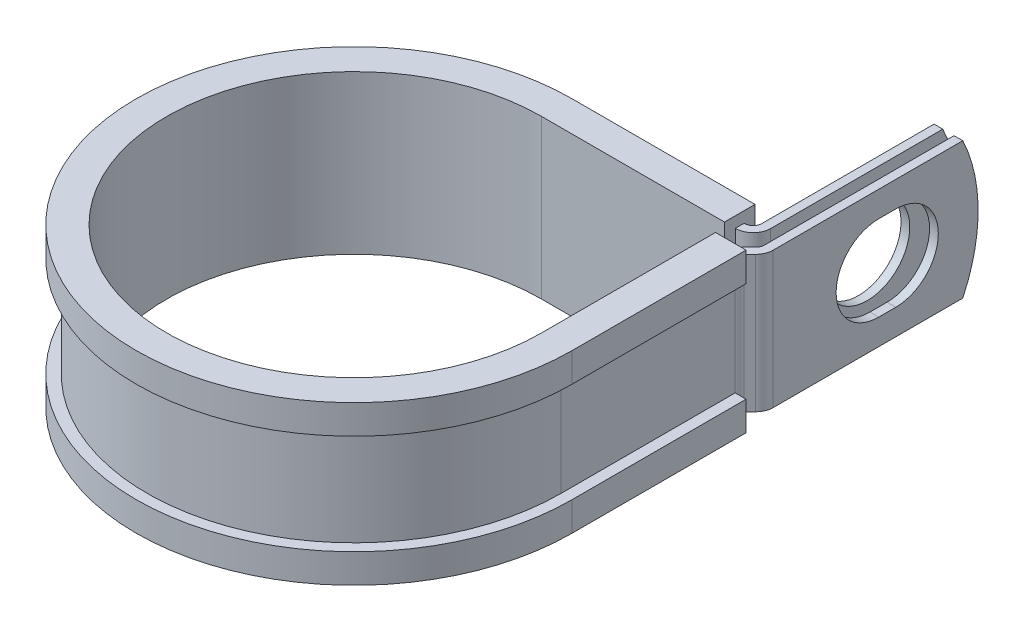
ISO-10303-21;
HEADER;
FILE_DESCRIPTION(('STEP AP214'),'2;1');
FILE_NAME('part.step','',(''),(''),'','','');
FILE_SCHEMA(('AUTOMOTIVE_DESIGN { 1 0 10303 214 1 1 1 1 }'));
ENDSEC;
DATA;
#1=APPLICATION_CONTEXT('core data for automotive mechanical design processes');
#2=APPLICATION_PROTOCOL_DEFINITION('international standard','automotive_design',2000,#1);
#3=PRODUCT_CONTEXT('',#1,'mechanical');
#4=PRODUCT('Part','Part','',(#3));
#5=PRODUCT_RELATED_PRODUCT_CATEGORY('part','',(#4));
#6=PRODUCT_DEFINITION_FORMATION('','',#4);
#7=PRODUCT_DEFINITION_CONTEXT('part definition',#1,'design');
#8=PRODUCT_DEFINITION('design','',#6,#7);
#9=PRODUCT_DEFINITION_SHAPE('','',#8);
#10=(LENGTH_UNIT() NAMED_UNIT(*) SI_UNIT(.MILLI.,.METRE.));
#11=(NAMED_UNIT(*) PLANE_ANGLE_UNIT() SI_UNIT($,.RADIAN.));
#12=(NAMED_UNIT(*) SI_UNIT($,.STERADIAN.) SOLID_ANGLE_UNIT());
#13=UNCERTAINTY_MEASURE_WITH_UNIT(LENGTH_MEASURE(1.E-05),#10,'distance_accuracy_value','');
#14=(GEOMETRIC_REPRESENTATION_CONTEXT(3) GLOBAL_UNCERTAINTY_ASSIGNED_CONTEXT((#13)) GLOBAL_UNIT_ASSIGNED_CONTEXT((#10,
#11,#12)) REPRESENTATION_CONTEXT('',''));
#15=CARTESIAN_POINT('',(0.,0.,0.));
#16=DIRECTION('',(0.,0.,1.));
#17=DIRECTION('',(1.,0.,0.));
#18=AXIS2_PLACEMENT_3D('',#15,#16,#17);
#19=CARTESIAN_POINT('',(28.3896698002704,-9.525,-27.7114));
#20=DIRECTION('',(0.,1.,0.));
#21=DIRECTION('',(1.,0.,0.));
#22=AXIS2_PLACEMENT_3D('',#19,#20,#21);
#23=PLANE('',#22);
#24=DIRECTION('',(0.,0.,-1.));
#25=VECTOR('',#24,1.);
#26=CARTESIAN_POINT('',(25.5448698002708,-9.525,-27.7114));
#27=LINE('',#26,#25);
#28=CARTESIAN_POINT('',(25.5448698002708,-9.525,-27.7114));
#29=VERTEX_POINT('',#28);
#30=CARTESIAN_POINT('',(25.5448698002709,-9.525,-28.9306));
#31=VERTEX_POINT('',#30);
#32=EDGE_CURVE('E524',#29,#31,#27,.T.);
#33=ORIENTED_EDGE('',*,*,#32,.T.);
#34=DIRECTION('',(1.,0.,0.));
#35=VECTOR('',#34,1.);
#36=CARTESIAN_POINT('',(0.,-9.525,-28.9306));
#37=LINE('',#36,#35);
#38=CARTESIAN_POINT('',(25.5956698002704,-9.525,-28.9306));
#39=VERTEX_POINT('',#38);
#40=EDGE_CURVE('E411',#39,#31,#37,.F.);
#41=ORIENTED_EDGE('',*,*,#40,.F.);
#42=CARTESIAN_POINT('',(25.5956698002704,-9.525,-30.1498));
#43=DIRECTION('',(0.,1.,0.));
#44=DIRECTION('',(1.,0.,0.));
#45=AXIS2_PLACEMENT_3D('',#42,#43,#44);
#46=CIRCLE('',#45,1.2192);
#47=CARTESIAN_POINT('',(26.8148698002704,-9.525,-30.1498));
#48=VERTEX_POINT('',#47);
#49=EDGE_CURVE('E409',#48,#39,#46,.F.);
#50=ORIENTED_EDGE('',*,*,#49,.F.);
#51=DIRECTION('',(0.,0.,1.));
#52=VECTOR('',#51,1.);
#53=CARTESIAN_POINT('',(26.8148698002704,-9.525,-56.3372));
#54=LINE('',#53,#52);
#55=CARTESIAN_POINT('',(26.8148698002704,-9.525,-54.1926631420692));
#56=VERTEX_POINT('',#55);
#57=EDGE_CURVE('E407',#56,#48,#54,.T.);
#58=ORIENTED_EDGE('',*,*,#57,.F.);
#59=DIRECTION('',(-1.,0.,0.));
#60=VECTOR('',#59,1.);
#61=CARTESIAN_POINT('',(30.8280698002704,-9.525,-54.1926631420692));
#62=LINE('',#61,#60);
#63=CARTESIAN_POINT('',(28.0340698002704,-9.525,-54.1926631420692));
#64=VERTEX_POINT('',#63);
#65=EDGE_CURVE('E12',#64,#56,#62,.T.);
#66=ORIENTED_EDGE('',*,*,#65,.F.);
#67=DIRECTION('',(0.,0.,1.));
#68=VECTOR('',#67,1.);
#69=CARTESIAN_POINT('',(28.0340698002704,-9.525,-56.3372));
#70=LINE('',#69,#68);
#71=CARTESIAN_POINT('',(28.0340698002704,-9.525,-30.1498));
#72=VERTEX_POINT('',#71);
#73=EDGE_CURVE('E405',#64,#72,#70,.T.);
#74=ORIENTED_EDGE('',*,*,#73,.T.);
#75=CARTESIAN_POINT('',(25.5956698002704,-9.525,-30.1498));
#76=DIRECTION('',(0.,-1.,0.));
#77=DIRECTION('',(0.,0.,1.));
#78=AXIS2_PLACEMENT_3D('',#75,#76,#77);
#79=CIRCLE('',#78,2.4384);
#80=CARTESIAN_POINT('',(25.5956698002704,-9.525,-27.7114));
#81=VERTEX_POINT('',#80);
#82=EDGE_CURVE('E402',#72,#81,#79,.T.);
#83=ORIENTED_EDGE('',*,*,#82,.T.);
#84=DIRECTION('',(-1.,0.,0.));
#85=VECTOR('',#84,1.);
#86=CARTESIAN_POINT('',(0.,-9.525,-27.7114));
#87=LINE('',#86,#85);
#88=EDGE_CURVE('E399',#81,#29,#87,.T.);
#89=ORIENTED_EDGE('',*,*,#88,.T.);
#90=EDGE_LOOP('',(#33,#41,#50,#58,#66,#74,#83,#89));
#91=FACE_BOUND('',#90,.T.);
#92=ADVANCED_FACE('F55',(#91),#23,.F.);
#93=CARTESIAN_POINT('',(28.3896698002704,9.525,-27.7114));
#94=DIRECTION('',(0.,1.,0.));
#95=DIRECTION('',(1.,0.,0.));
#96=AXIS2_PLACEMENT_3D('',#93,#94,#95);
#97=PLANE('',#96);
#98=DIRECTION('',(1.,0.,0.));
#99=VECTOR('',#98,1.);
#100=CARTESIAN_POINT('',(0.,9.525,-28.9306));
#101=LINE('',#100,#99);
#102=CARTESIAN_POINT('',(25.5956698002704,9.525,-28.9306));
#103=VERTEX_POINT('',#102);
#104=CARTESIAN_POINT('',(25.5448698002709,9.525,-28.9306));
#105=VERTEX_POINT('',#104);
#106=EDGE_CURVE('E369',#103,#105,#101,.F.);
#107=ORIENTED_EDGE('',*,*,#106,.T.);
#108=DIRECTION('',(0.,0.,1.));
#109=VECTOR('',#108,1.);
#110=CARTESIAN_POINT('',(25.5448698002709,9.525,-28.9306));
#111=LINE('',#110,#109);
#112=CARTESIAN_POINT('',(25.5448698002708,9.525,-27.7114));
#113=VERTEX_POINT('',#112);
#114=EDGE_CURVE('E518',#105,#113,#111,.T.);
#115=ORIENTED_EDGE('',*,*,#114,.T.);
#116=DIRECTION('',(-1.,0.,0.));
#117=VECTOR('',#116,1.);
#118=CARTESIAN_POINT('',(0.,9.525,-27.7114));
#119=LINE('',#118,#117);
#120=CARTESIAN_POINT('',(25.5956698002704,9.525,-27.7114));
#121=VERTEX_POINT('',#120);
#122=EDGE_CURVE('E626',#121,#113,#119,.T.);
#123=ORIENTED_EDGE('',*,*,#122,.F.);
#124=CARTESIAN_POINT('',(25.5956698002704,9.525,-30.1498));
#125=DIRECTION('',(0.,-1.,0.));
#126=DIRECTION('',(0.,0.,1.));
#127=AXIS2_PLACEMENT_3D('',#124,#125,#126);
#128=CIRCLE('',#127,2.4384);
#129=CARTESIAN_POINT('',(28.0340698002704,9.525,-30.1498));
#130=VERTEX_POINT('',#129);
#131=EDGE_CURVE('E371',#130,#121,#128,.T.);
#132=ORIENTED_EDGE('',*,*,#131,.F.);
#133=DIRECTION('',(0.,0.,1.));
#134=VECTOR('',#133,1.);
#135=CARTESIAN_POINT('',(28.0340698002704,9.525,-56.3372));
#136=LINE('',#135,#134);
#137=CARTESIAN_POINT('',(28.0340698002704,9.525,-54.1926631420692));
#138=VERTEX_POINT('',#137);
#139=EDGE_CURVE('E362',#138,#130,#136,.T.);
#140=ORIENTED_EDGE('',*,*,#139,.F.);
#141=DIRECTION('',(-1.,0.,0.));
#142=VECTOR('',#141,1.);
#143=CARTESIAN_POINT('',(30.8280698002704,9.525,-54.1926631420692));
#144=LINE('',#143,#142);
#145=CARTESIAN_POINT('',(26.8148698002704,9.525,-54.1926631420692));
#146=VERTEX_POINT('',#145);
#147=EDGE_CURVE('E63',#138,#146,#144,.T.);
#148=ORIENTED_EDGE('',*,*,#147,.T.);
#149=DIRECTION('',(0.,0.,1.));
#150=VECTOR('',#149,1.);
#151=CARTESIAN_POINT('',(26.8148698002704,9.525,-56.3372));
#152=LINE('',#151,#150);
#153=CARTESIAN_POINT('',(26.8148698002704,9.525,-30.1498));
#154=VERTEX_POINT('',#153);
#155=EDGE_CURVE('E359',#146,#154,#152,.T.);
#156=ORIENTED_EDGE('',*,*,#155,.T.);
#157=CARTESIAN_POINT('',(25.5956698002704,9.525,-30.1498));
#158=DIRECTION('',(0.,1.,0.));
#159=DIRECTION('',(1.,0.,0.));
#160=AXIS2_PLACEMENT_3D('',#157,#158,#159);
#161=CIRCLE('',#160,1.2192);
#162=EDGE_CURVE('E367',#154,#103,#161,.F.);
#163=ORIENTED_EDGE('',*,*,#162,.T.);
#164=EDGE_LOOP('',(#107,#115,#123,#132,#140,#148,#156,#163));
#165=FACE_BOUND('',#164,.T.);
#166=ADVANCED_FACE('F358',(#165),#97,.T.);
#167=CARTESIAN_POINT('',(0.,9.525,-27.7114));
#168=DIRECTION('',(0.,0.,1.));
#169=DIRECTION('',(1.,0.,0.));
#170=AXIS2_PLACEMENT_3D('',#167,#168,#169);
#171=PLANE('',#170);
#172=ORIENTED_EDGE('',*,*,#122,.T.);
#173=DIRECTION('',(0.,-1.,0.));
#174=VECTOR('',#173,1.);
#175=CARTESIAN_POINT('',(25.5448698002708,9.525,-27.7114));
#176=LINE('',#175,#174);
#177=EDGE_CURVE('E521',#113,#29,#176,.T.);
#178=ORIENTED_EDGE('',*,*,#177,.T.);
#179=ORIENTED_EDGE('',*,*,#88,.F.);
#180=DIRECTION('',(0.,-1.,0.));
#181=VECTOR('',#180,1.);
#182=CARTESIAN_POINT('',(25.5956698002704,9.525,-27.7114));
#183=LINE('',#182,#181);
#184=EDGE_CURVE('E345',#121,#81,#183,.T.);
#185=ORIENTED_EDGE('',*,*,#184,.F.);
#186=EDGE_LOOP('',(#172,#178,#179,#185));
#187=FACE_BOUND('',#186,.T.);
#188=ADVANCED_FACE('F636',(#187),#171,.T.);
#189=CARTESIAN_POINT('',(30.8280698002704,9.525,-27.7114));
#190=DIRECTION('',(-1.,0.,0.));
#191=DIRECTION('',(0.,0.,1.));
#192=AXIS2_PLACEMENT_3D('',#189,#190,#191);
#193=PLANE('',#192);
#194=CARTESIAN_POINT('',(30.8280698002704,0.,-44.8309999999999));
#195=DIRECTION('',(1.,0.,0.));
#196=DIRECTION('',(0.,0.,-1.));
#197=AXIS2_PLACEMENT_3D('',#194,#195,#196);
#198=CIRCLE('',#197,5.9436);
#199=CARTESIAN_POINT('',(30.8280698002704,-5.9436,-44.8310000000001));
#200=VERTEX_POINT('',#199);
#201=CARTESIAN_POINT('',(30.8280698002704,5.9436,-44.8310000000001));
#202=VERTEX_POINT('',#201);
#203=EDGE_CURVE('E581',#200,#202,#198,.T.);
#204=ORIENTED_EDGE('',*,*,#203,.F.);
#205=DIRECTION('',(0.,0.,-1.));
#206=VECTOR('',#205,1.);
#207=CARTESIAN_POINT('',(30.8280698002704,-5.9436,-42.4433999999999));
#208=LINE('',#207,#206);
#209=CARTESIAN_POINT('',(30.8280698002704,-5.9436,-42.4433999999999));
#210=VERTEX_POINT('',#209);
#211=EDGE_CURVE('E584',#210,#200,#208,.T.);
#212=ORIENTED_EDGE('',*,*,#211,.F.);
#213=CARTESIAN_POINT('',(30.8280698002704,0.,-42.4433999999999));
#214=DIRECTION('',(1.,0.,0.));
#215=DIRECTION('',(0.,0.,-1.));
#216=AXIS2_PLACEMENT_3D('',#213,#214,#215);
#217=CIRCLE('',#216,5.9436);
#218=CARTESIAN_POINT('',(30.8280698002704,5.9436,-42.4433999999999));
#219=VERTEX_POINT('',#218);
#220=EDGE_CURVE('E577',#219,#210,#217,.T.);
#221=ORIENTED_EDGE('',*,*,#220,.F.);
#222=DIRECTION('',(0.,0.,1.));
#223=VECTOR('',#222,1.);
#224=CARTESIAN_POINT('',(30.8280698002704,5.9436,-42.4433999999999));
#225=LINE('',#224,#223);
#226=EDGE_CURVE('E578',#202,#219,#225,.T.);
#227=ORIENTED_EDGE('',*,*,#226,.F.);
#228=EDGE_LOOP('',(#204,#212,#221,#227));
#229=FACE_BOUND('',#228,.T.);
#230=DIRECTION('',(0.,0.,-1.));
#231=VECTOR('',#230,1.);
#232=CARTESIAN_POINT('',(30.8280698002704,-9.525,-27.7114));
#233=LINE('',#232,#231);
#234=CARTESIAN_POINT('',(30.8280698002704,-9.525,-27.7114));
#235=VERTEX_POINT('',#234);
#236=CARTESIAN_POINT('',(30.8280698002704,-9.525,-54.1926631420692));
#237=VERTEX_POINT('',#236);
#238=EDGE_CURVE('E383',#235,#237,#233,.T.);
#239=ORIENTED_EDGE('',*,*,#238,.T.);
#240=CARTESIAN_POINT('',(30.8280698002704,0.,-34.1122));
#241=DIRECTION('',(-1.,0.,0.));
#242=DIRECTION('',(0.,0.,1.));
#243=AXIS2_PLACEMENT_3D('',#240,#241,#242);
#244=CIRCLE('',#243,22.225);
#245=CARTESIAN_POINT('',(30.8280698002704,9.525,-54.1926631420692));
#246=VERTEX_POINT('',#245);
#247=EDGE_CURVE('E569',#246,#237,#244,.T.);
#248=ORIENTED_EDGE('',*,*,#247,.F.);
#249=DIRECTION('',(0.,0.,-1.));
#250=VECTOR('',#249,1.);
#251=CARTESIAN_POINT('',(30.8280698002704,9.525,-27.7114));
#252=LINE('',#251,#250);
#253=CARTESIAN_POINT('',(30.8280698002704,9.525,-27.7114));
#254=VERTEX_POINT('',#253);
#255=EDGE_CURVE('E420',#254,#246,#252,.T.);
#256=ORIENTED_EDGE('',*,*,#255,.F.);
#257=DIRECTION('',(0.,-1.,0.));
#258=VECTOR('',#257,1.);
#259=CARTESIAN_POINT('',(30.8280698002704,9.525,-27.7114));
#260=LINE('',#259,#258);
#261=EDGE_CURVE('E382',#254,#235,#260,.T.);
#262=ORIENTED_EDGE('',*,*,#261,.T.);
#263=EDGE_LOOP('',(#239,#248,#256,#262));
#264=FACE_BOUND('',#263,.T.);
#265=ADVANCED_FACE('F57',(#229,#264),#193,.F.);
#266=CARTESIAN_POINT('',(29.6088698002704,9.525,-27.7114));
#267=DIRECTION('',(-1.,0.,0.));
#268=DIRECTION('',(0.,0.,1.));
#269=AXIS2_PLACEMENT_3D('',#266,#267,#268);
#270=PLANE('',#269);
#271=DIRECTION('',(0.,0.,-1.));
#272=VECTOR('',#271,1.);
#273=CARTESIAN_POINT('',(29.6088698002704,-5.9436,-42.4433999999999));
#274=LINE('',#273,#272);
#275=CARTESIAN_POINT('',(29.6088698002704,-5.9436,-42.4433999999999));
#276=VERTEX_POINT('',#275);
#277=CARTESIAN_POINT('',(29.6088698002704,-5.9436,-44.8310000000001));
#278=VERTEX_POINT('',#277);
#279=EDGE_CURVE('E580',#276,#278,#274,.T.);
#280=ORIENTED_EDGE('',*,*,#279,.T.);
#281=CARTESIAN_POINT('',(29.6088698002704,0.,-44.8309999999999));
#282=DIRECTION('',(-1.,0.,0.));
#283=DIRECTION('',(0.,0.,1.));
#284=AXIS2_PLACEMENT_3D('',#281,#282,#283);
#285=CIRCLE('',#284,5.9436);
#286=CARTESIAN_POINT('',(29.6088698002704,5.9436,-44.8310000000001));
#287=VERTEX_POINT('',#286);
#288=EDGE_CURVE('E601',#278,#287,#285,.F.);
#289=ORIENTED_EDGE('',*,*,#288,.T.);
#290=DIRECTION('',(0.,0.,1.));
#291=VECTOR('',#290,1.);
#292=CARTESIAN_POINT('',(29.6088698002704,5.9436,-42.4433999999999));
#293=LINE('',#292,#291);
#294=CARTESIAN_POINT('',(29.6088698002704,5.9436,-42.4433999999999));
#295=VERTEX_POINT('',#294);
#296=EDGE_CURVE('E597',#287,#295,#293,.T.);
#297=ORIENTED_EDGE('',*,*,#296,.T.);
#298=CARTESIAN_POINT('',(29.6088698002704,0.,-42.4433999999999));
#299=DIRECTION('',(-1.,0.,0.));
#300=DIRECTION('',(0.,0.,1.));
#301=AXIS2_PLACEMENT_3D('',#298,#299,#300);
#302=CIRCLE('',#301,5.9436);
#303=EDGE_CURVE('E592',#295,#276,#302,.F.);
#304=ORIENTED_EDGE('',*,*,#303,.T.);
#305=EDGE_LOOP('',(#280,#289,#297,#304));
#306=FACE_BOUND('',#305,.T.);
#307=CARTESIAN_POINT('',(29.6088698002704,0.,-34.1122));
#308=DIRECTION('',(-1.,0.,0.));
#309=DIRECTION('',(0.,0.,1.));
#310=AXIS2_PLACEMENT_3D('',#307,#308,#309);
#311=CIRCLE('',#310,22.225);
#312=CARTESIAN_POINT('',(29.6088698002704,9.525,-54.1926631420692));
#313=VERTEX_POINT('',#312);
#314=CARTESIAN_POINT('',(29.6088698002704,-9.525,-54.1926631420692));
#315=VERTEX_POINT('',#314);
#316=EDGE_CURVE('E77',#313,#315,#311,.T.);
#317=ORIENTED_EDGE('',*,*,#316,.T.);
#318=DIRECTION('',(0.,0.,-1.));
#319=VECTOR('',#318,1.);
#320=CARTESIAN_POINT('',(29.6088698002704,-9.525,-27.7114));
#321=LINE('',#320,#319);
#322=CARTESIAN_POINT('',(29.6088698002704,-9.525,-27.7114));
#323=VERTEX_POINT('',#322);
#324=EDGE_CURVE('E386',#323,#315,#321,.T.);
#325=ORIENTED_EDGE('',*,*,#324,.F.);
#326=DIRECTION('',(0.,-1.,0.));
#327=VECTOR('',#326,1.);
#328=CARTESIAN_POINT('',(29.6088698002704,9.525,-27.7114));
#329=LINE('',#328,#327);
#330=CARTESIAN_POINT('',(29.6088698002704,9.525,-27.7114));
#331=VERTEX_POINT('',#330);
#332=EDGE_CURVE('E353',#331,#323,#329,.T.);
#333=ORIENTED_EDGE('',*,*,#332,.F.);
#334=DIRECTION('',(0.,0.,-1.));
#335=VECTOR('',#334,1.);
#336=CARTESIAN_POINT('',(29.6088698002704,9.525,-27.7114));
#337=LINE('',#336,#335);
#338=EDGE_CURVE('E616',#331,#313,#337,.T.);
#339=ORIENTED_EDGE('',*,*,#338,.T.);
#340=EDGE_LOOP('',(#317,#325,#333,#339));
#341=FACE_BOUND('',#340,.T.);
#342=ADVANCED_FACE('F690',(#306,#341),#270,.T.);
#343=CARTESIAN_POINT('',(28.0340698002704,9.525,-56.3372));
#344=DIRECTION('',(1.,0.,0.));
#345=DIRECTION('',(0.,0.,-1.));
#346=AXIS2_PLACEMENT_3D('',#343,#344,#345);
#347=PLANE('',#346);
#348=CARTESIAN_POINT('',(28.0340698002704,0.,-43.6372));
#349=DIRECTION('',(1.,0.,0.));
#350=DIRECTION('',(0.,0.,-1.));
#351=AXIS2_PLACEMENT_3D('',#348,#349,#350);
#352=CIRCLE('',#351,5.9436);
#353=CARTESIAN_POINT('',(28.0340698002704,0.,-49.5808));
#354=VERTEX_POINT('',#353);
#355=EDGE_CURVE('E387',#354,#354,#352,.F.);
#356=ORIENTED_EDGE('',*,*,#355,.T.);
#357=EDGE_LOOP('',(#356));
#358=FACE_BOUND('',#357,.T.);
#359=ORIENTED_EDGE('',*,*,#73,.F.);
#360=CARTESIAN_POINT('',(28.0340698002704,0.,-34.1122));
#361=DIRECTION('',(1.,0.,0.));
#362=DIRECTION('',(0.,0.,-1.));
#363=AXIS2_PLACEMENT_3D('',#360,#361,#362);
#364=CIRCLE('',#363,22.225);
#365=EDGE_CURVE('E574',#64,#138,#364,.T.);
#366=ORIENTED_EDGE('',*,*,#365,.T.);
#367=ORIENTED_EDGE('',*,*,#139,.T.);
#368=DIRECTION('',(0.,-1.,0.));
#369=VECTOR('',#368,1.);
#370=CARTESIAN_POINT('',(28.0340698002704,9.525,-30.1498));
#371=LINE('',#370,#369);
#372=EDGE_CURVE('E342',#130,#72,#371,.T.);
#373=ORIENTED_EDGE('',*,*,#372,.T.);
#374=EDGE_LOOP('',(#359,#366,#367,#373));
#375=FACE_BOUND('',#374,.T.);
#376=ADVANCED_FACE('F642',(#358,#375),#347,.T.);
#377=CARTESIAN_POINT('',(26.8148698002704,9.525,-56.3372));
#378=DIRECTION('',(1.,0.,0.));
#379=DIRECTION('',(0.,0.,-1.));
#380=AXIS2_PLACEMENT_3D('',#377,#378,#379);
#381=PLANE('',#380);
#382=CARTESIAN_POINT('',(26.8148698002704,0.,-43.6372));
#383=DIRECTION('',(-1.,0.,0.));
#384=DIRECTION('',(0.,0.,1.));
#385=AXIS2_PLACEMENT_3D('',#382,#383,#384);
#386=CIRCLE('',#385,5.9436);
#387=CARTESIAN_POINT('',(26.8148698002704,0.,-37.6936));
#388=VERTEX_POINT('',#387);
#389=EDGE_CURVE('E609',#388,#388,#386,.T.);
#390=ORIENTED_EDGE('',*,*,#389,.F.);
#391=EDGE_LOOP('',(#390));
#392=FACE_BOUND('',#391,.T.);
#393=CARTESIAN_POINT('',(26.8148698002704,0.,-34.1122));
#394=DIRECTION('',(-1.,0.,0.));
#395=DIRECTION('',(0.,0.,1.));
#396=AXIS2_PLACEMENT_3D('',#393,#394,#395);
#397=CIRCLE('',#396,22.225);
#398=EDGE_CURVE('E69',#146,#56,#397,.T.);
#399=ORIENTED_EDGE('',*,*,#398,.T.);
#400=ORIENTED_EDGE('',*,*,#57,.T.);
#401=DIRECTION('',(0.,-1.,0.));
#402=VECTOR('',#401,1.);
#403=CARTESIAN_POINT('',(26.8148698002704,9.525,-30.1498));
#404=LINE('',#403,#402);
#405=EDGE_CURVE('E339',#154,#48,#404,.T.);
#406=ORIENTED_EDGE('',*,*,#405,.F.);
#407=ORIENTED_EDGE('',*,*,#155,.F.);
#408=EDGE_LOOP('',(#399,#400,#406,#407));
#409=FACE_BOUND('',#408,.T.);
#410=ADVANCED_FACE('F365',(#392,#409),#381,.F.);
#411=CARTESIAN_POINT('',(30.1498,-9.525,-24.2989026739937));
#412=DIRECTION('',(0.,1.,0.));
#413=DIRECTION('',(1.,0.,0.));
#414=AXIS2_PLACEMENT_3D('',#411,#412,#413);
#415=CIRCLE('',#414,1.2192);
#416=CARTESIAN_POINT('',(28.9306,-9.525,-24.2989026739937));
#417=VERTEX_POINT('',#416);
#418=CARTESIAN_POINT('',(29.2876954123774,-9.525,-25.1610072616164));
#419=VERTEX_POINT('',#418);
#420=EDGE_CURVE('E414',#417,#419,#415,.F.);
#421=ORIENTED_EDGE('',*,*,#420,.F.);
#422=DIRECTION('',(1.,0.,0.));
#423=VECTOR('',#422,1.);
#424=CARTESIAN_POINT('',(27.7114,-9.525,-24.2989026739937));
#425=LINE('',#424,#423);
#426=CARTESIAN_POINT('',(27.7114,-9.525,-24.2989026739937));
#427=VERTEX_POINT('',#426);
#428=EDGE_CURVE('E452',#427,#417,#425,.T.);
#429=ORIENTED_EDGE('',*,*,#428,.F.);
#430=CARTESIAN_POINT('',(30.1498,-9.525,-24.2989026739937));
#431=DIRECTION('',(0.,-1.,0.));
#432=DIRECTION('',(0.,0.,1.));
#433=AXIS2_PLACEMENT_3D('',#430,#431,#432);
#434=CIRCLE('',#433,2.4384);
#435=CARTESIAN_POINT('',(28.4255908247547,-9.525,-26.023111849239));
#436=VERTEX_POINT('',#435);
#437=EDGE_CURVE('E396',#427,#436,#434,.T.);
#438=ORIENTED_EDGE('',*,*,#437,.T.);
#439=DIRECTION('',(0.707106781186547,0.,-0.707106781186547));
#440=VECTOR('',#439,1.);
#441=CARTESIAN_POINT('',(28.4255908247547,-9.525,-26.023111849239));
#442=LINE('',#441,#440);
#443=CARTESIAN_POINT('',(29.2517743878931,-9.525,-26.8492954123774));
#444=VERTEX_POINT('',#443);
#445=EDGE_CURVE('E393',#436,#444,#442,.T.);
#446=ORIENTED_EDGE('',*,*,#445,.T.);
#447=CARTESIAN_POINT('',(28.3896698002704,-9.525,-27.7114));
#448=DIRECTION('',(0.,1.,0.));
#449=DIRECTION('',(0.,0.,1.));
#450=AXIS2_PLACEMENT_3D('',#447,#448,#449);
#451=CIRCLE('',#450,1.2192);
#452=EDGE_CURVE('E390',#444,#323,#451,.T.);
#453=ORIENTED_EDGE('',*,*,#452,.T.);
#454=ORIENTED_EDGE('',*,*,#324,.T.);
#455=DIRECTION('',(-1.,0.,0.));
#456=VECTOR('',#455,1.);
#457=CARTESIAN_POINT('',(30.8280698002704,-9.525,-54.1926631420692));
#458=LINE('',#457,#456);
#459=EDGE_CURVE('E567',#237,#315,#458,.T.);
#460=ORIENTED_EDGE('',*,*,#459,.F.);
#461=ORIENTED_EDGE('',*,*,#238,.F.);
#462=CARTESIAN_POINT('',(28.3896698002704,-9.525,-27.7114));
#463=DIRECTION('',(0.,1.,0.));
#464=DIRECTION('',(1.,0.,0.));
#465=AXIS2_PLACEMENT_3D('',#462,#463,#464);
#466=CIRCLE('',#465,2.4384);
#467=CARTESIAN_POINT('',(30.1138789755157,-9.525,-25.9871908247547));
#468=VERTEX_POINT('',#467);
#469=EDGE_CURVE('E418',#468,#235,#466,.T.);
#470=ORIENTED_EDGE('',*,*,#469,.F.);
#471=DIRECTION('',(0.707106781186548,0.,-0.707106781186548));
#472=VECTOR('',#471,1.);
#473=CARTESIAN_POINT('',(29.2876954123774,-9.525,-25.1610072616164));
#474=LINE('',#473,#472);
#475=EDGE_CURVE('E416',#419,#468,#474,.T.);
#476=ORIENTED_EDGE('',*,*,#475,.F.);
#477=EDGE_LOOP('',(#421,#429,#438,#446,#453,#454,#460,#461,#470,#476));
#478=FACE_BOUND('',#477,.T.);
#479=ADVANCED_FACE('F676',(#478),#23,.F.);
#480=DIRECTION('',(-1.,0.,0.));
#481=VECTOR('',#480,1.);
#482=CARTESIAN_POINT('',(28.9306,9.525,-24.2989026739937));
#483=LINE('',#482,#481);
#484=CARTESIAN_POINT('',(28.9306,9.525,-24.2989026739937));
#485=VERTEX_POINT('',#484);
#486=CARTESIAN_POINT('',(27.7114,9.525,-24.2989026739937));
#487=VERTEX_POINT('',#486);
#488=EDGE_CURVE('E441',#485,#487,#483,.T.);
#489=ORIENTED_EDGE('',*,*,#488,.F.);
#490=CARTESIAN_POINT('',(30.1498,9.525,-24.2989026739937));
#491=DIRECTION('',(0.,1.,0.));
#492=DIRECTION('',(1.,0.,0.));
#493=AXIS2_PLACEMENT_3D('',#490,#491,#492);
#494=CIRCLE('',#493,1.2192);
#495=CARTESIAN_POINT('',(29.2876954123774,9.525,-25.1610072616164));
#496=VERTEX_POINT('',#495);
#497=EDGE_CURVE('E376',#485,#496,#494,.F.);
#498=ORIENTED_EDGE('',*,*,#497,.T.);
#499=DIRECTION('',(0.707106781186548,0.,-0.707106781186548));
#500=VECTOR('',#499,1.);
#501=CARTESIAN_POINT('',(29.2876954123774,9.525,-25.1610072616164));
#502=LINE('',#501,#500);
#503=CARTESIAN_POINT('',(30.1138789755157,9.525,-25.9871908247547));
#504=VERTEX_POINT('',#503);
#505=EDGE_CURVE('E378',#496,#504,#502,.T.);
#506=ORIENTED_EDGE('',*,*,#505,.T.);
#507=CARTESIAN_POINT('',(28.3896698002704,9.525,-27.7114));
#508=DIRECTION('',(0.,1.,0.));
#509=DIRECTION('',(1.,0.,0.));
#510=AXIS2_PLACEMENT_3D('',#507,#508,#509);
#511=CIRCLE('',#510,2.4384);
#512=EDGE_CURVE('E380',#504,#254,#511,.T.);
#513=ORIENTED_EDGE('',*,*,#512,.T.);
#514=ORIENTED_EDGE('',*,*,#255,.T.);
#515=DIRECTION('',(-1.,0.,0.));
#516=VECTOR('',#515,1.);
#517=CARTESIAN_POINT('',(30.8280698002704,9.525,-54.1926631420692));
#518=LINE('',#517,#516);
#519=EDGE_CURVE('E571',#246,#313,#518,.T.);
#520=ORIENTED_EDGE('',*,*,#519,.T.);
#521=ORIENTED_EDGE('',*,*,#338,.F.);
#522=CARTESIAN_POINT('',(28.3896698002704,9.525,-27.7114));
#523=DIRECTION('',(0.,1.,0.));
#524=DIRECTION('',(0.,0.,1.));
#525=AXIS2_PLACEMENT_3D('',#522,#523,#524);
#526=CIRCLE('',#525,1.2192);
#527=CARTESIAN_POINT('',(29.2517743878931,9.525,-26.8492954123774));
#528=VERTEX_POINT('',#527);
#529=EDGE_CURVE('E619',#528,#331,#526,.T.);
#530=ORIENTED_EDGE('',*,*,#529,.F.);
#531=DIRECTION('',(0.707106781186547,0.,-0.707106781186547));
#532=VECTOR('',#531,1.);
#533=CARTESIAN_POINT('',(28.4255908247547,9.525,-26.023111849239));
#534=LINE('',#533,#532);
#535=CARTESIAN_POINT('',(28.4255908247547,9.525,-26.023111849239));
#536=VERTEX_POINT('',#535);
#537=EDGE_CURVE('E622',#536,#528,#534,.T.);
#538=ORIENTED_EDGE('',*,*,#537,.F.);
#539=CARTESIAN_POINT('',(30.1498,9.525,-24.2989026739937));
#540=DIRECTION('',(0.,-1.,0.));
#541=DIRECTION('',(0.,0.,1.));
#542=AXIS2_PLACEMENT_3D('',#539,#540,#541);
#543=CIRCLE('',#542,2.4384);
#544=EDGE_CURVE('E451',#487,#536,#543,.T.);
#545=ORIENTED_EDGE('',*,*,#544,.F.);
#546=EDGE_LOOP('',(#489,#498,#506,#513,#514,#520,#521,#530,#538,#545));
#547=FACE_BOUND('',#546,.T.);
#548=ADVANCED_FACE('F448',(#547),#97,.T.);
#549=CARTESIAN_POINT('',(28.3896698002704,9.525,-27.7114));
#550=DIRECTION('',(0.,-1.,0.));
#551=DIRECTION('',(0.,0.,-1.));
#552=AXIS2_PLACEMENT_3D('',#549,#550,#551);
#553=CYLINDRICAL_SURFACE('',#552,1.2192);
#554=ORIENTED_EDGE('',*,*,#452,.F.);
#555=DIRECTION('',(0.,-1.,0.));
#556=VECTOR('',#555,1.);
#557=CARTESIAN_POINT('',(29.2517743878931,9.525,-26.8492954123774));
#558=LINE('',#557,#556);
#559=EDGE_CURVE('E351',#528,#444,#558,.T.);
#560=ORIENTED_EDGE('',*,*,#559,.F.);
#561=ORIENTED_EDGE('',*,*,#529,.T.);
#562=ORIENTED_EDGE('',*,*,#332,.T.);
#563=EDGE_LOOP('',(#554,#560,#561,#562));
#564=FACE_BOUND('',#563,.T.);
#565=ADVANCED_FACE('F686',(#564),#553,.F.);
#566=CARTESIAN_POINT('',(28.4255908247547,9.525,-26.023111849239));
#567=DIRECTION('',(-0.707106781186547,0.,-0.707106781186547));
#568=DIRECTION('',(-0.707106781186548,0.,0.707106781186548));
#569=AXIS2_PLACEMENT_3D('',#566,#567,#568);
#570=PLANE('',#569);
#571=ORIENTED_EDGE('',*,*,#445,.F.);
#572=DIRECTION('',(0.,-1.,0.));
#573=VECTOR('',#572,1.);
#574=CARTESIAN_POINT('',(28.4255908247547,9.525,-26.023111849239));
#575=LINE('',#574,#573);
#576=EDGE_CURVE('E349',#536,#436,#575,.T.);
#577=ORIENTED_EDGE('',*,*,#576,.F.);
#578=ORIENTED_EDGE('',*,*,#537,.T.);
#579=ORIENTED_EDGE('',*,*,#559,.T.);
#580=EDGE_LOOP('',(#571,#577,#578,#579));
#581=FACE_BOUND('',#580,.T.);
#582=ADVANCED_FACE('F681',(#581),#570,.T.);
#583=CARTESIAN_POINT('',(30.1498,9.525,-24.2989026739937));
#584=DIRECTION('',(0.,-1.,0.));
#585=DIRECTION('',(0.,0.,-1.));
#586=AXIS2_PLACEMENT_3D('',#583,#584,#585);
#587=CYLINDRICAL_SURFACE('',#586,2.4384);
#588=ORIENTED_EDGE('',*,*,#437,.F.);
#589=DIRECTION('',(0.,-1.,0.));
#590=VECTOR('',#589,1.);
#591=CARTESIAN_POINT('',(27.7114,9.525,-24.2989026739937));
#592=LINE('',#591,#590);
#593=EDGE_CURVE('E347',#487,#427,#592,.T.);
#594=ORIENTED_EDGE('',*,*,#593,.F.);
#595=ORIENTED_EDGE('',*,*,#544,.T.);
#596=ORIENTED_EDGE('',*,*,#576,.T.);
#597=EDGE_LOOP('',(#588,#594,#595,#596));
#598=FACE_BOUND('',#597,.T.);
#599=ADVANCED_FACE('F678',(#598),#587,.T.);
#600=CARTESIAN_POINT('',(25.5956698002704,9.525,-30.1498));
#601=DIRECTION('',(0.,-1.,0.));
#602=DIRECTION('',(0.,0.,-1.));
#603=AXIS2_PLACEMENT_3D('',#600,#601,#602);
#604=CYLINDRICAL_SURFACE('',#603,2.4384);
#605=ORIENTED_EDGE('',*,*,#82,.F.);
#606=ORIENTED_EDGE('',*,*,#372,.F.);
#607=ORIENTED_EDGE('',*,*,#131,.T.);
#608=ORIENTED_EDGE('',*,*,#184,.T.);
#609=EDGE_LOOP('',(#605,#606,#607,#608));
#610=FACE_BOUND('',#609,.T.);
#611=ADVANCED_FACE('F632',(#610),#604,.T.);
#612=CARTESIAN_POINT('',(25.5956698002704,9.525,-30.1498));
#613=DIRECTION('',(0.,-1.,0.));
#614=DIRECTION('',(0.,0.,-1.));
#615=AXIS2_PLACEMENT_3D('',#612,#613,#614);
#616=CYLINDRICAL_SURFACE('',#615,1.2192);
#617=ORIENTED_EDGE('',*,*,#49,.T.);
#618=DIRECTION('',(0.,-1.,0.));
#619=VECTOR('',#618,1.);
#620=CARTESIAN_POINT('',(25.5956698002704,9.525,-28.9306));
#621=LINE('',#620,#619);
#622=EDGE_CURVE('E330',#103,#39,#621,.T.);
#623=ORIENTED_EDGE('',*,*,#622,.F.);
#624=ORIENTED_EDGE('',*,*,#162,.F.);
#625=ORIENTED_EDGE('',*,*,#405,.T.);
#626=EDGE_LOOP('',(#617,#623,#624,#625));
#627=FACE_BOUND('',#626,.T.);
#628=ADVANCED_FACE('F647',(#627),#616,.F.);
#629=CARTESIAN_POINT('',(0.,9.525,-28.9306));
#630=DIRECTION('',(0.,0.,1.));
#631=DIRECTION('',(1.,0.,0.));
#632=AXIS2_PLACEMENT_3D('',#629,#630,#631);
#633=PLANE('',#632);
#634=DIRECTION('',(0.,-1.,0.));
#635=VECTOR('',#634,1.);
#636=CARTESIAN_POINT('',(0.,9.525,-28.9306));
#637=LINE('',#636,#635);
#638=CARTESIAN_POINT('',(4.05814088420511E-13,6.985,-28.9306));
#639=VERTEX_POINT('',#638);
#640=CARTESIAN_POINT('',(4.05814088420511E-13,-6.985,-28.9306));
#641=VERTEX_POINT('',#640);
#642=EDGE_CURVE('E321',#639,#641,#637,.T.);
#643=ORIENTED_EDGE('',*,*,#642,.F.);
#644=DIRECTION('',(1.,0.,0.));
#645=VECTOR('',#644,1.);
#646=CARTESIAN_POINT('',(4.05814088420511E-13,6.985,-28.9306));
#647=LINE('',#646,#645);
#648=CARTESIAN_POINT('',(25.5448698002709,6.985,-28.9306));
#649=VERTEX_POINT('',#648);
#650=EDGE_CURVE('E564',#639,#649,#647,.T.);
#651=ORIENTED_EDGE('',*,*,#650,.T.);
#652=DIRECTION('',(0.,1.,0.));
#653=VECTOR('',#652,1.);
#654=CARTESIAN_POINT('',(25.5448698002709,9.525,-28.9306));
#655=LINE('',#654,#653);
#656=EDGE_CURVE('E515',#649,#105,#655,.T.);
#657=ORIENTED_EDGE('',*,*,#656,.T.);
#658=ORIENTED_EDGE('',*,*,#106,.F.);
#659=ORIENTED_EDGE('',*,*,#622,.T.);
#660=ORIENTED_EDGE('',*,*,#40,.T.);
#661=DIRECTION('',(0.,1.,0.));
#662=VECTOR('',#661,1.);
#663=CARTESIAN_POINT('',(25.5448698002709,-9.525,-28.9306));
#664=LINE('',#663,#662);
#665=CARTESIAN_POINT('',(25.5448698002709,-6.985,-28.9306));
#666=VERTEX_POINT('',#665);
#667=EDGE_CURVE('E527',#31,#666,#664,.T.);
#668=ORIENTED_EDGE('',*,*,#667,.T.);
#669=DIRECTION('',(1.,0.,0.));
#670=VECTOR('',#669,1.);
#671=CARTESIAN_POINT('',(4.05814088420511E-13,-6.985,-28.9306));
#672=LINE('',#671,#670);
#673=EDGE_CURVE('E544',#641,#666,#672,.T.);
#674=ORIENTED_EDGE('',*,*,#673,.F.);
#675=EDGE_LOOP('',(#643,#651,#657,#658,#659,#660,#668,#674));
#676=FACE_BOUND('',#675,.T.);
#677=ADVANCED_FACE('F651',(#676),#633,.F.);
#678=CARTESIAN_POINT('',(0.,9.525,0.));
#679=DIRECTION('',(0.,-1.,0.));
#680=DIRECTION('',(0.,0.,-1.));
#681=AXIS2_PLACEMENT_3D('',#678,#679,#680);
#682=CYLINDRICAL_SURFACE('',#681,28.9306);
#683=DIRECTION('',(0.,-1.,0.));
#684=VECTOR('',#683,1.);
#685=CARTESIAN_POINT('',(28.9306,9.525,0.));
#686=LINE('',#685,#684);
#687=CARTESIAN_POINT('',(28.9306,6.985,0.));
#688=VERTEX_POINT('',#687);
#689=CARTESIAN_POINT('',(28.9306,-6.985,0.));
#690=VERTEX_POINT('',#689);
#691=EDGE_CURVE('E319',#688,#690,#686,.T.);
#692=ORIENTED_EDGE('',*,*,#691,.F.);
#693=CARTESIAN_POINT('',(0.,6.985,0.));
#694=DIRECTION('',(0.,-1.,0.));
#695=DIRECTION('',(0.,0.,-1.));
#696=AXIS2_PLACEMENT_3D('',#693,#694,#695);
#697=CIRCLE('',#696,28.9306);
#698=EDGE_CURVE('E513',#688,#639,#697,.T.);
#699=ORIENTED_EDGE('',*,*,#698,.T.);
#700=ORIENTED_EDGE('',*,*,#642,.T.);
#701=CARTESIAN_POINT('',(0.,-6.985,0.));
#702=DIRECTION('',(0.,-1.,0.));
#703=DIRECTION('',(0.,0.,-1.));
#704=AXIS2_PLACEMENT_3D('',#701,#702,#703);
#705=CIRCLE('',#704,28.9306);
#706=EDGE_CURVE('E302',#690,#641,#705,.T.);
#707=ORIENTED_EDGE('',*,*,#706,.F.);
#708=EDGE_LOOP('',(#692,#699,#700,#707));
#709=FACE_BOUND('',#708,.T.);
#710=ADVANCED_FACE('F317',(#709),#682,.T.);
#711=CARTESIAN_POINT('',(28.9306,9.525,0.));
#712=DIRECTION('',(-1.,0.,0.));
#713=DIRECTION('',(0.,0.,1.));
#714=AXIS2_PLACEMENT_3D('',#711,#712,#713);
#715=PLANE('',#714);
#716=DIRECTION('',(0.,-1.,0.));
#717=VECTOR('',#716,1.);
#718=CARTESIAN_POINT('',(28.9306,9.525,-24.2989026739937));
#719=LINE('',#718,#717);
#720=CARTESIAN_POINT('',(28.9306,6.985,-24.2989026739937));
#721=VERTEX_POINT('',#720);
#722=CARTESIAN_POINT('',(28.9306,-6.985,-24.2989026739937));
#723=VERTEX_POINT('',#722);
#724=EDGE_CURVE('E333',#721,#723,#719,.T.);
#725=ORIENTED_EDGE('',*,*,#724,.F.);
#726=DIRECTION('',(0.,0.,-1.));
#727=VECTOR('',#726,1.);
#728=CARTESIAN_POINT('',(28.9306,6.985,0.));
#729=LINE('',#728,#727);
#730=EDGE_CURVE('E327',#688,#721,#729,.T.);
#731=ORIENTED_EDGE('',*,*,#730,.F.);
#732=ORIENTED_EDGE('',*,*,#691,.T.);
#733=DIRECTION('',(0.,0.,-1.));
#734=VECTOR('',#733,1.);
#735=CARTESIAN_POINT('',(28.9306,-6.985,0.));
#736=LINE('',#735,#734);
#737=EDGE_CURVE('E298',#690,#723,#736,.T.);
#738=ORIENTED_EDGE('',*,*,#737,.T.);
#739=EDGE_LOOP('',(#725,#731,#732,#738));
#740=FACE_BOUND('',#739,.T.);
#741=ADVANCED_FACE('F326',(#740),#715,.F.);
#742=CARTESIAN_POINT('',(30.1498,9.525,-24.2989026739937));
#743=DIRECTION('',(0.,-1.,0.));
#744=DIRECTION('',(0.,0.,-1.));
#745=AXIS2_PLACEMENT_3D('',#742,#743,#744);
#746=CYLINDRICAL_SURFACE('',#745,1.2192);
#747=ORIENTED_EDGE('',*,*,#420,.T.);
#748=DIRECTION('',(0.,-1.,0.));
#749=VECTOR('',#748,1.);
#750=CARTESIAN_POINT('',(29.2876954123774,9.525,-25.1610072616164));
#751=LINE('',#750,#749);
#752=EDGE_CURVE('E425',#496,#419,#751,.T.);
#753=ORIENTED_EDGE('',*,*,#752,.F.);
#754=ORIENTED_EDGE('',*,*,#497,.F.);
#755=EDGE_CURVE('E328',#485,#721,#719,.T.);
#756=ORIENTED_EDGE('',*,*,#755,.T.);
#757=ORIENTED_EDGE('',*,*,#724,.T.);
#758=DIRECTION('',(0.,1.,0.));
#759=VECTOR('',#758,1.);
#760=CARTESIAN_POINT('',(28.9306,-9.525,-24.2989026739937));
#761=LINE('',#760,#759);
#762=EDGE_CURVE('E434',#417,#723,#761,.T.);
#763=ORIENTED_EDGE('',*,*,#762,.F.);
#764=EDGE_LOOP('',(#747,#753,#754,#756,#757,#763));
#765=FACE_BOUND('',#764,.T.);
#766=ADVANCED_FACE('F433',(#765),#746,.F.);
#767=CARTESIAN_POINT('',(29.2876954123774,9.525,-25.1610072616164));
#768=DIRECTION('',(-0.707106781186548,0.,-0.707106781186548));
#769=DIRECTION('',(-0.707106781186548,0.,0.707106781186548));
#770=AXIS2_PLACEMENT_3D('',#767,#768,#769);
#771=PLANE('',#770);
#772=ORIENTED_EDGE('',*,*,#475,.T.);
#773=DIRECTION('',(0.,-1.,0.));
#774=VECTOR('',#773,1.);
#775=CARTESIAN_POINT('',(30.1138789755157,9.525,-25.9871908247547));
#776=LINE('',#775,#774);
#777=EDGE_CURVE('E423',#504,#468,#776,.T.);
#778=ORIENTED_EDGE('',*,*,#777,.F.);
#779=ORIENTED_EDGE('',*,*,#505,.F.);
#780=ORIENTED_EDGE('',*,*,#752,.T.);
#781=EDGE_LOOP('',(#772,#778,#779,#780));
#782=FACE_BOUND('',#781,.T.);
#783=ADVANCED_FACE('F702',(#782),#771,.F.);
#784=CARTESIAN_POINT('',(28.3896698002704,9.525,-27.7114));
#785=DIRECTION('',(0.,-1.,0.));
#786=DIRECTION('',(0.,0.,-1.));
#787=AXIS2_PLACEMENT_3D('',#784,#785,#786);
#788=CYLINDRICAL_SURFACE('',#787,2.4384);
#789=ORIENTED_EDGE('',*,*,#469,.T.);
#790=ORIENTED_EDGE('',*,*,#261,.F.);
#791=ORIENTED_EDGE('',*,*,#512,.F.);
#792=ORIENTED_EDGE('',*,*,#777,.T.);
#793=EDGE_LOOP('',(#789,#790,#791,#792));
#794=FACE_BOUND('',#793,.T.);
#795=ADVANCED_FACE('F700',(#794),#788,.T.);
#796=CARTESIAN_POINT('',(44.8451092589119,0.,-43.6372));
#797=DIRECTION('',(-1.,0.,0.));
#798=DIRECTION('',(0.,0.,1.));
#799=AXIS2_PLACEMENT_3D('',#796,#797,#798);
#800=CYLINDRICAL_SURFACE('',#799,5.9436);
#801=ORIENTED_EDGE('',*,*,#389,.T.);
#802=EDGE_LOOP('',(#801));
#803=FACE_BOUND('',#802,.T.);
#804=ORIENTED_EDGE('',*,*,#355,.F.);
#805=EDGE_LOOP('',(#804));
#806=FACE_BOUND('',#805,.T.);
#807=ADVANCED_FACE('F709',(#803,#806),#800,.F.);
#808=CARTESIAN_POINT('',(11.0326635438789,-5.9436,-42.4433999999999));
#809=DIRECTION('',(0.,-1.,0.));
#810=DIRECTION('',(0.,0.,-1.));
#811=AXIS2_PLACEMENT_3D('',#808,#809,#810);
#812=PLANE('',#811);
#813=DIRECTION('',(1.,0.,0.));
#814=VECTOR('',#813,1.);
#815=CARTESIAN_POINT('',(11.0326635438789,-5.9436,-42.4433999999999));
#816=LINE('',#815,#814);
#817=EDGE_CURVE('E595',#276,#210,#816,.T.);
#818=ORIENTED_EDGE('',*,*,#817,.T.);
#819=ORIENTED_EDGE('',*,*,#211,.T.);
#820=DIRECTION('',(1.,0.,0.));
#821=VECTOR('',#820,1.);
#822=CARTESIAN_POINT('',(11.0326635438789,-5.9436,-44.8310000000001));
#823=LINE('',#822,#821);
#824=EDGE_CURVE('E591',#278,#200,#823,.T.);
#825=ORIENTED_EDGE('',*,*,#824,.F.);
#826=ORIENTED_EDGE('',*,*,#279,.F.);
#827=EDGE_LOOP('',(#818,#819,#825,#826));
#828=FACE_BOUND('',#827,.T.);
#829=ADVANCED_FACE('F752',(#828),#812,.F.);
#830=CARTESIAN_POINT('',(11.0326635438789,0.,-44.8309999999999));
#831=DIRECTION('',(1.,0.,0.));
#832=DIRECTION('',(0.,0.,-1.));
#833=AXIS2_PLACEMENT_3D('',#830,#831,#832);
#834=CYLINDRICAL_SURFACE('',#833,5.9436);
#835=ORIENTED_EDGE('',*,*,#824,.T.);
#836=ORIENTED_EDGE('',*,*,#203,.T.);
#837=DIRECTION('',(1.,0.,0.));
#838=VECTOR('',#837,1.);
#839=CARTESIAN_POINT('',(11.0326635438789,5.9436,-44.8310000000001));
#840=LINE('',#839,#838);
#841=EDGE_CURVE('E600',#287,#202,#840,.T.);
#842=ORIENTED_EDGE('',*,*,#841,.F.);
#843=ORIENTED_EDGE('',*,*,#288,.F.);
#844=EDGE_LOOP('',(#835,#836,#842,#843));
#845=FACE_BOUND('',#844,.T.);
#846=ADVANCED_FACE('F756',(#845),#834,.F.);
#847=CARTESIAN_POINT('',(11.0326635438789,5.9436,-42.4433999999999));
#848=DIRECTION('',(0.,1.,0.));
#849=DIRECTION('',(0.,0.,1.));
#850=AXIS2_PLACEMENT_3D('',#847,#848,#849);
#851=PLANE('',#850);
#852=ORIENTED_EDGE('',*,*,#841,.T.);
#853=ORIENTED_EDGE('',*,*,#226,.T.);
#854=DIRECTION('',(1.,0.,0.));
#855=VECTOR('',#854,1.);
#856=CARTESIAN_POINT('',(11.0326635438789,5.9436,-42.4433999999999));
#857=LINE('',#856,#855);
#858=EDGE_CURVE('E596',#295,#219,#857,.T.);
#859=ORIENTED_EDGE('',*,*,#858,.F.);
#860=ORIENTED_EDGE('',*,*,#296,.F.);
#861=EDGE_LOOP('',(#852,#853,#859,#860));
#862=FACE_BOUND('',#861,.T.);
#863=ADVANCED_FACE('F760',(#862),#851,.F.);
#864=CARTESIAN_POINT('',(11.0326635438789,0.,-42.4433999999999));
#865=DIRECTION('',(1.,0.,0.));
#866=DIRECTION('',(0.,0.,-1.));
#867=AXIS2_PLACEMENT_3D('',#864,#865,#866);
#868=CYLINDRICAL_SURFACE('',#867,5.9436);
#869=ORIENTED_EDGE('',*,*,#858,.T.);
#870=ORIENTED_EDGE('',*,*,#220,.T.);
#871=ORIENTED_EDGE('',*,*,#817,.F.);
#872=ORIENTED_EDGE('',*,*,#303,.F.);
#873=EDGE_LOOP('',(#869,#870,#871,#872));
#874=FACE_BOUND('',#873,.T.);
#875=ADVANCED_FACE('F764',(#874),#868,.F.);
#876=CARTESIAN_POINT('',(30.8280698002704,0.,-34.1122));
#877=DIRECTION('',(-1.,0.,0.));
#878=DIRECTION('',(0.,0.,1.));
#879=AXIS2_PLACEMENT_3D('',#876,#877,#878);
#880=CYLINDRICAL_SURFACE('',#879,22.225);
#881=ORIENTED_EDGE('',*,*,#365,.F.);
#882=ORIENTED_EDGE('',*,*,#65,.T.);
#883=ORIENTED_EDGE('',*,*,#398,.F.);
#884=ORIENTED_EDGE('',*,*,#147,.F.);
#885=EDGE_LOOP('',(#881,#882,#883,#884));
#886=FACE_BOUND('',#885,.T.);
#887=ADVANCED_FACE('F643',(#886),#880,.T.);
#888=ORIENTED_EDGE('',*,*,#519,.F.);
#889=ORIENTED_EDGE('',*,*,#247,.T.);
#890=ORIENTED_EDGE('',*,*,#459,.T.);
#891=ORIENTED_EDGE('',*,*,#316,.F.);
#892=EDGE_LOOP('',(#888,#889,#890,#891));
#893=FACE_BOUND('',#892,.T.);
#894=ADVANCED_FACE('F691',(#893),#880,.T.);
#895=CARTESIAN_POINT('',(4.27191476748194E-13,11.049,-30.4546));
#896=DIRECTION('',(0.,0.,1.));
#897=DIRECTION('',(1.,0.,0.));
#898=AXIS2_PLACEMENT_3D('',#895,#896,#897);
#899=PLANE('',#898);
#900=DIRECTION('',(0.,-1.,0.));
#901=VECTOR('',#900,1.);
#902=CARTESIAN_POINT('',(4.27191476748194E-13,11.049,-30.4546));
#903=LINE('',#902,#901);
#904=CARTESIAN_POINT('',(4.27191476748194E-13,11.049,-30.4546));
#905=VERTEX_POINT('',#904);
#906=CARTESIAN_POINT('',(4.27191476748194E-13,6.985,-30.4546));
#907=VERTEX_POINT('',#906);
#908=EDGE_CURVE('E323',#905,#907,#903,.T.);
#909=ORIENTED_EDGE('',*,*,#908,.F.);
#910=DIRECTION('',(1.,0.,0.));
#911=VECTOR('',#910,1.);
#912=CARTESIAN_POINT('',(4.27191476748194E-13,11.049,-30.4546));
#913=LINE('',#912,#911);
#914=CARTESIAN_POINT('',(25.5448698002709,11.049,-30.4546));
#915=VERTEX_POINT('',#914);
#916=EDGE_CURVE('E558',#905,#915,#913,.T.);
#917=ORIENTED_EDGE('',*,*,#916,.T.);
#918=DIRECTION('',(0.,-1.,0.));
#919=VECTOR('',#918,1.);
#920=CARTESIAN_POINT('',(25.5448698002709,11.049,-30.4546));
#921=LINE('',#920,#919);
#922=CARTESIAN_POINT('',(25.5448698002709,6.985,-30.4546));
#923=VERTEX_POINT('',#922);
#924=EDGE_CURVE('E540',#915,#923,#921,.T.);
#925=ORIENTED_EDGE('',*,*,#924,.T.);
#926=DIRECTION('',(1.,0.,0.));
#927=VECTOR('',#926,1.);
#928=CARTESIAN_POINT('',(4.27191476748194E-13,6.985,-30.4546));
#929=LINE('',#928,#927);
#930=EDGE_CURVE('E561',#907,#923,#929,.T.);
#931=ORIENTED_EDGE('',*,*,#930,.F.);
#932=EDGE_LOOP('',(#909,#917,#925,#931));
#933=FACE_BOUND('',#932,.T.);
#934=ADVANCED_FACE('F855',(#933),#899,.F.);
#935=CARTESIAN_POINT('',(3.67334789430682E-13,11.049,-26.1874));
#936=DIRECTION('',(0.,0.,-1.));
#937=DIRECTION('',(0.,1.,0.));
#938=AXIS2_PLACEMENT_3D('',#935,#936,#937);
#939=PLANE('',#938);
#940=DIRECTION('',(0.,1.,0.));
#941=VECTOR('',#940,1.);
#942=CARTESIAN_POINT('',(3.67334789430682E-13,11.049,-26.1874));
#943=LINE('',#942,#941);
#944=CARTESIAN_POINT('',(3.67334789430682E-13,-11.049,-26.1874));
#945=VERTEX_POINT('',#944);
#946=CARTESIAN_POINT('',(3.67334789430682E-13,11.049,-26.1874));
#947=VERTEX_POINT('',#946);
#948=EDGE_CURVE('E491',#945,#947,#943,.T.);
#949=ORIENTED_EDGE('',*,*,#948,.F.);
#950=DIRECTION('',(1.,0.,0.));
#951=VECTOR('',#950,1.);
#952=CARTESIAN_POINT('',(3.67334789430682E-13,-11.049,-26.1874));
#953=LINE('',#952,#951);
#954=CARTESIAN_POINT('',(25.5448698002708,-11.049,-26.1874));
#955=VERTEX_POINT('',#954);
#956=EDGE_CURVE('E552',#945,#955,#953,.T.);
#957=ORIENTED_EDGE('',*,*,#956,.T.);
#958=DIRECTION('',(0.,1.,0.));
#959=VECTOR('',#958,1.);
#960=CARTESIAN_POINT('',(25.5448698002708,11.049,-26.1874));
#961=LINE('',#960,#959);
#962=CARTESIAN_POINT('',(25.5448698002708,11.049,-26.1874));
#963=VERTEX_POINT('',#962);
#964=EDGE_CURVE('E536',#955,#963,#961,.T.);
#965=ORIENTED_EDGE('',*,*,#964,.T.);
#966=DIRECTION('',(1.,0.,0.));
#967=VECTOR('',#966,1.);
#968=CARTESIAN_POINT('',(3.67334789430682E-13,11.049,-26.1874));
#969=LINE('',#968,#967);
#970=EDGE_CURVE('E555',#947,#963,#969,.T.);
#971=ORIENTED_EDGE('',*,*,#970,.F.);
#972=EDGE_LOOP('',(#949,#957,#965,#971));
#973=FACE_BOUND('',#972,.T.);
#974=ADVANCED_FACE('F941',(#973),#939,.F.);
#975=CARTESIAN_POINT('',(4.27191476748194E-13,-11.049,-30.4546));
#976=DIRECTION('',(0.,0.,1.));
#977=DIRECTION('',(1.,0.,0.));
#978=AXIS2_PLACEMENT_3D('',#975,#976,#977);
#979=PLANE('',#978);
#980=DIRECTION('',(0.,-1.,0.));
#981=VECTOR('',#980,1.);
#982=CARTESIAN_POINT('',(4.27191476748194E-13,-11.049,-30.4546));
#983=LINE('',#982,#981);
#984=CARTESIAN_POINT('',(4.27191476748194E-13,-6.985,-30.4546));
#985=VERTEX_POINT('',#984);
#986=CARTESIAN_POINT('',(4.27191476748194E-13,-11.049,-30.4546));
#987=VERTEX_POINT('',#986);
#988=EDGE_CURVE('E477',#985,#987,#983,.T.);
#989=ORIENTED_EDGE('',*,*,#988,.F.);
#990=DIRECTION('',(1.,0.,0.));
#991=VECTOR('',#990,1.);
#992=CARTESIAN_POINT('',(4.27191476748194E-13,-6.985,-30.4546));
#993=LINE('',#992,#991);
#994=CARTESIAN_POINT('',(25.5448698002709,-6.985,-30.4546));
#995=VERTEX_POINT('',#994);
#996=EDGE_CURVE('E546',#985,#995,#993,.T.);
#997=ORIENTED_EDGE('',*,*,#996,.T.);
#998=DIRECTION('',(0.,-1.,0.));
#999=VECTOR('',#998,1.);
#1000=CARTESIAN_POINT('',(25.5448698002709,-11.049,-30.4546));
#1001=LINE('',#1000,#999);
#1002=CARTESIAN_POINT('',(25.5448698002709,-11.049,-30.4546));
#1003=VERTEX_POINT('',#1002);
#1004=EDGE_CURVE('E532',#995,#1003,#1001,.T.);
#1005=ORIENTED_EDGE('',*,*,#1004,.T.);
#1006=DIRECTION('',(1.,0.,0.));
#1007=VECTOR('',#1006,1.);
#1008=CARTESIAN_POINT('',(4.27191476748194E-13,-11.049,-30.4546));
#1009=LINE('',#1008,#1007);
#1010=EDGE_CURVE('E549',#987,#1003,#1009,.T.);
#1011=ORIENTED_EDGE('',*,*,#1010,.F.);
#1012=EDGE_LOOP('',(#989,#997,#1005,#1011));
#1013=FACE_BOUND('',#1012,.T.);
#1014=ADVANCED_FACE('F662',(#1013),#979,.F.);
#1015=CARTESIAN_POINT('',(0.,9.525,0.));
#1016=DIRECTION('',(0.,-1.,0.));
#1017=DIRECTION('',(0.,0.,-1.));
#1018=AXIS2_PLACEMENT_3D('',#1015,#1016,#1017);
#1019=CYLINDRICAL_SURFACE('',#1018,30.4546);
#1020=DIRECTION('',(0.,-1.,0.));
#1021=VECTOR('',#1020,1.);
#1022=CARTESIAN_POINT('',(30.4546,11.049,0.));
#1023=LINE('',#1022,#1021);
#1024=CARTESIAN_POINT('',(30.4546,11.049,0.));
#1025=VERTEX_POINT('',#1024);
#1026=CARTESIAN_POINT('',(30.4546,6.985,0.));
#1027=VERTEX_POINT('',#1026);
#1028=EDGE_CURVE('E312',#1025,#1027,#1023,.T.);
#1029=ORIENTED_EDGE('',*,*,#1028,.F.);
#1030=CARTESIAN_POINT('',(0.,11.049,0.));
#1031=DIRECTION('',(0.,-1.,0.));
#1032=DIRECTION('',(0.,0.,-1.));
#1033=AXIS2_PLACEMENT_3D('',#1030,#1031,#1032);
#1034=CIRCLE('',#1033,30.4546);
#1035=EDGE_CURVE('E507',#1025,#905,#1034,.T.);
#1036=ORIENTED_EDGE('',*,*,#1035,.T.);
#1037=ORIENTED_EDGE('',*,*,#908,.T.);
#1038=CARTESIAN_POINT('',(0.,6.985,0.));
#1039=DIRECTION('',(0.,-1.,0.));
#1040=DIRECTION('',(0.,0.,-1.));
#1041=AXIS2_PLACEMENT_3D('',#1038,#1039,#1040);
#1042=CIRCLE('',#1041,30.4546);
#1043=EDGE_CURVE('E510',#1027,#907,#1042,.T.);
#1044=ORIENTED_EDGE('',*,*,#1043,.F.);
#1045=EDGE_LOOP('',(#1029,#1036,#1037,#1044));
#1046=FACE_BOUND('',#1045,.T.);
#1047=ADVANCED_FACE('F961',(#1046),#1019,.T.);
#1048=CARTESIAN_POINT('',(0.,9.525,0.));
#1049=DIRECTION('',(0.,-1.,0.));
#1050=DIRECTION('',(0.,0.,-1.));
#1051=AXIS2_PLACEMENT_3D('',#1048,#1049,#1050);
#1052=CYLINDRICAL_SURFACE('',#1051,26.1874);
#1053=DIRECTION('',(0.,1.,0.));
#1054=VECTOR('',#1053,1.);
#1055=CARTESIAN_POINT('',(26.1874,11.049,0.));
#1056=LINE('',#1055,#1054);
#1057=CARTESIAN_POINT('',(26.1874,-11.049,0.));
#1058=VERTEX_POINT('',#1057);
#1059=CARTESIAN_POINT('',(26.1874,11.049,0.));
#1060=VERTEX_POINT('',#1059);
#1061=EDGE_CURVE('E1124',#1058,#1060,#1056,.T.);
#1062=ORIENTED_EDGE('',*,*,#1061,.F.);
#1063=CARTESIAN_POINT('',(0.,-11.049,0.));
#1064=DIRECTION('',(0.,-1.,0.));
#1065=DIRECTION('',(0.,0.,-1.));
#1066=AXIS2_PLACEMENT_3D('',#1063,#1064,#1065);
#1067=CIRCLE('',#1066,26.1874);
#1068=EDGE_CURVE('E501',#1058,#945,#1067,.T.);
#1069=ORIENTED_EDGE('',*,*,#1068,.T.);
#1070=ORIENTED_EDGE('',*,*,#948,.T.);
#1071=CARTESIAN_POINT('',(0.,11.049,0.));
#1072=DIRECTION('',(0.,-1.,0.));
#1073=DIRECTION('',(0.,0.,-1.));
#1074=AXIS2_PLACEMENT_3D('',#1071,#1072,#1073);
#1075=CIRCLE('',#1074,26.1874);
#1076=EDGE_CURVE('E504',#1060,#947,#1075,.T.);
#1077=ORIENTED_EDGE('',*,*,#1076,.F.);
#1078=EDGE_LOOP('',(#1062,#1069,#1070,#1077));
#1079=FACE_BOUND('',#1078,.T.);
#1080=ADVANCED_FACE('F971',(#1079),#1052,.F.);
#1081=CARTESIAN_POINT('',(0.,9.525,0.));
#1082=DIRECTION('',(0.,-1.,0.));
#1083=DIRECTION('',(0.,0.,-1.));
#1084=AXIS2_PLACEMENT_3D('',#1081,#1082,#1083);
#1085=CYLINDRICAL_SURFACE('',#1084,30.4546);
#1086=DIRECTION('',(0.,-1.,0.));
#1087=VECTOR('',#1086,1.);
#1088=CARTESIAN_POINT('',(30.4546,-11.049,0.));
#1089=LINE('',#1088,#1087);
#1090=CARTESIAN_POINT('',(30.4546,-6.985,0.));
#1091=VERTEX_POINT('',#1090);
#1092=CARTESIAN_POINT('',(30.4546,-11.049,0.));
#1093=VERTEX_POINT('',#1092);
#1094=EDGE_CURVE('E475',#1091,#1093,#1089,.T.);
#1095=ORIENTED_EDGE('',*,*,#1094,.F.);
#1096=CARTESIAN_POINT('',(0.,-6.985,0.));
#1097=DIRECTION('',(0.,-1.,0.));
#1098=DIRECTION('',(0.,0.,-1.));
#1099=AXIS2_PLACEMENT_3D('',#1096,#1097,#1098);
#1100=CIRCLE('',#1099,30.4546);
#1101=EDGE_CURVE('E322',#1091,#985,#1100,.T.);
#1102=ORIENTED_EDGE('',*,*,#1101,.T.);
#1103=ORIENTED_EDGE('',*,*,#988,.T.);
#1104=CARTESIAN_POINT('',(0.,-11.049,0.));
#1105=DIRECTION('',(0.,-1.,0.));
#1106=DIRECTION('',(0.,0.,-1.));
#1107=AXIS2_PLACEMENT_3D('',#1104,#1105,#1106);
#1108=CIRCLE('',#1107,30.4546);
#1109=EDGE_CURVE('E498',#1093,#987,#1108,.T.);
#1110=ORIENTED_EDGE('',*,*,#1109,.F.);
#1111=EDGE_LOOP('',(#1095,#1102,#1103,#1110));
#1112=FACE_BOUND('',#1111,.T.);
#1113=ADVANCED_FACE('F665',(#1112),#1085,.T.);
#1114=CARTESIAN_POINT('',(30.4546,6.985,0.));
#1115=DIRECTION('',(0.,-1.,0.));
#1116=DIRECTION('',(0.,0.,-1.));
#1117=AXIS2_PLACEMENT_3D('',#1114,#1115,#1116);
#1118=PLANE('',#1117);
#1119=DIRECTION('',(-1.,0.,0.));
#1120=VECTOR('',#1119,1.);
#1121=CARTESIAN_POINT('',(30.4546,6.985,-24.2989026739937));
#1122=LINE('',#1121,#1120);
#1123=CARTESIAN_POINT('',(30.4546,6.985,-24.2989026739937));
#1124=VERTEX_POINT('',#1123);
#1125=EDGE_CURVE('E445',#1124,#721,#1122,.T.);
#1126=ORIENTED_EDGE('',*,*,#1125,.F.);
#1127=DIRECTION('',(0.,0.,-1.));
#1128=VECTOR('',#1127,1.);
#1129=CARTESIAN_POINT('',(30.4546,6.985,0.));
#1130=LINE('',#1129,#1128);
#1131=EDGE_CURVE('E478',#1027,#1124,#1130,.T.);
#1132=ORIENTED_EDGE('',*,*,#1131,.F.);
#1133=ORIENTED_EDGE('',*,*,#1043,.T.);
#1134=ORIENTED_EDGE('',*,*,#930,.T.);
#1135=DIRECTION('',(0.,0.,1.));
#1136=VECTOR('',#1135,1.);
#1137=CARTESIAN_POINT('',(25.5448698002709,6.985,-30.4546));
#1138=LINE('',#1137,#1136);
#1139=EDGE_CURVE('E542',#923,#649,#1138,.T.);
#1140=ORIENTED_EDGE('',*,*,#1139,.T.);
#1141=ORIENTED_EDGE('',*,*,#650,.F.);
#1142=ORIENTED_EDGE('',*,*,#698,.F.);
#1143=ORIENTED_EDGE('',*,*,#730,.T.);
#1144=EDGE_LOOP('',(#1126,#1132,#1133,#1134,#1140,#1141,#1142,#1143));
#1145=FACE_BOUND('',#1144,.T.);
#1146=ADVANCED_FACE('F992',(#1145),#1118,.T.);
#1147=CARTESIAN_POINT('',(30.4546,11.049,0.));
#1148=DIRECTION('',(1.,0.,0.));
#1149=DIRECTION('',(0.,0.,-1.));
#1150=AXIS2_PLACEMENT_3D('',#1147,#1148,#1149);
#1151=PLANE('',#1150);
#1152=DIRECTION('',(0.,-1.,0.));
#1153=VECTOR('',#1152,1.);
#1154=CARTESIAN_POINT('',(30.4546,11.049,-24.2989026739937));
#1155=LINE('',#1154,#1153);
#1156=CARTESIAN_POINT('',(30.4546,11.049,-24.2989026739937));
#1157=VERTEX_POINT('',#1156);
#1158=EDGE_CURVE('E472',#1157,#1124,#1155,.T.);
#1159=ORIENTED_EDGE('',*,*,#1158,.F.);
#1160=DIRECTION('',(0.,0.,-1.));
#1161=VECTOR('',#1160,1.);
#1162=CARTESIAN_POINT('',(30.4546,11.049,0.));
#1163=LINE('',#1162,#1161);
#1164=EDGE_CURVE('E480',#1025,#1157,#1163,.T.);
#1165=ORIENTED_EDGE('',*,*,#1164,.F.);
#1166=ORIENTED_EDGE('',*,*,#1028,.T.);
#1167=ORIENTED_EDGE('',*,*,#1131,.T.);
#1168=EDGE_LOOP('',(#1159,#1165,#1166,#1167));
#1169=FACE_BOUND('',#1168,.T.);
#1170=ADVANCED_FACE('F1003',(#1169),#1151,.T.);
#1171=CARTESIAN_POINT('',(30.4546,11.049,0.));
#1172=DIRECTION('',(0.,1.,0.));
#1173=DIRECTION('',(0.,0.,1.));
#1174=AXIS2_PLACEMENT_3D('',#1171,#1172,#1173);
#1175=PLANE('',#1174);
#1176=DIRECTION('',(1.,0.,0.));
#1177=VECTOR('',#1176,1.);
#1178=CARTESIAN_POINT('',(30.4546,11.049,-24.2989026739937));
#1179=LINE('',#1178,#1177);
#1180=CARTESIAN_POINT('',(26.1874,11.049,-24.2989026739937));
#1181=VERTEX_POINT('',#1180);
#1182=EDGE_CURVE('E469',#1181,#1157,#1179,.T.);
#1183=ORIENTED_EDGE('',*,*,#1182,.F.);
#1184=DIRECTION('',(0.,0.,-1.));
#1185=VECTOR('',#1184,1.);
#1186=CARTESIAN_POINT('',(26.1874,11.049,0.));
#1187=LINE('',#1186,#1185);
#1188=EDGE_CURVE('E482',#1060,#1181,#1187,.T.);
#1189=ORIENTED_EDGE('',*,*,#1188,.F.);
#1190=ORIENTED_EDGE('',*,*,#1076,.T.);
#1191=ORIENTED_EDGE('',*,*,#970,.T.);
#1192=DIRECTION('',(0.,0.,-1.));
#1193=VECTOR('',#1192,1.);
#1194=CARTESIAN_POINT('',(25.5448698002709,11.049,-30.4546));
#1195=LINE('',#1194,#1193);
#1196=EDGE_CURVE('E538',#963,#915,#1195,.T.);
#1197=ORIENTED_EDGE('',*,*,#1196,.T.);
#1198=ORIENTED_EDGE('',*,*,#916,.F.);
#1199=ORIENTED_EDGE('',*,*,#1035,.F.);
#1200=ORIENTED_EDGE('',*,*,#1164,.T.);
#1201=EDGE_LOOP('',(#1183,#1189,#1190,#1191,#1197,#1198,#1199,#1200));
#1202=FACE_BOUND('',#1201,.T.);
#1203=ADVANCED_FACE('F1015',(#1202),#1175,.T.);
#1204=CARTESIAN_POINT('',(26.1874,11.049,0.));
#1205=DIRECTION('',(-1.,0.,0.));
#1206=DIRECTION('',(0.,-1.,0.));
#1207=AXIS2_PLACEMENT_3D('',#1204,#1205,#1206);
#1208=PLANE('',#1207);
#1209=DIRECTION('',(0.,1.,0.));
#1210=VECTOR('',#1209,1.);
#1211=CARTESIAN_POINT('',(26.1874,11.049,-24.2989026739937));
#1212=LINE('',#1211,#1210);
#1213=CARTESIAN_POINT('',(26.1874,-11.049,-24.2989026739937));
#1214=VERTEX_POINT('',#1213);
#1215=EDGE_CURVE('E466',#1214,#1181,#1212,.T.);
#1216=ORIENTED_EDGE('',*,*,#1215,.F.);
#1217=DIRECTION('',(0.,0.,-1.));
#1218=VECTOR('',#1217,1.);
#1219=CARTESIAN_POINT('',(26.1874,-11.049,0.));
#1220=LINE('',#1219,#1218);
#1221=EDGE_CURVE('E484',#1058,#1214,#1220,.T.);
#1222=ORIENTED_EDGE('',*,*,#1221,.F.);
#1223=ORIENTED_EDGE('',*,*,#1061,.T.);
#1224=ORIENTED_EDGE('',*,*,#1188,.T.);
#1225=EDGE_LOOP('',(#1216,#1222,#1223,#1224));
#1226=FACE_BOUND('',#1225,.T.);
#1227=ADVANCED_FACE('F1027',(#1226),#1208,.T.);
#1228=CARTESIAN_POINT('',(26.1874,-11.049,0.));
#1229=DIRECTION('',(0.,-1.,0.));
#1230=DIRECTION('',(0.,0.,-1.));
#1231=AXIS2_PLACEMENT_3D('',#1228,#1229,#1230);
#1232=PLANE('',#1231);
#1233=DIRECTION('',(-1.,0.,0.));
#1234=VECTOR('',#1233,1.);
#1235=CARTESIAN_POINT('',(26.1874,-11.049,-24.2989026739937));
#1236=LINE('',#1235,#1234);
#1237=CARTESIAN_POINT('',(30.4546,-11.049,-24.2989026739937));
#1238=VERTEX_POINT('',#1237);
#1239=EDGE_CURVE('E463',#1238,#1214,#1236,.T.);
#1240=ORIENTED_EDGE('',*,*,#1239,.F.);
#1241=DIRECTION('',(0.,0.,-1.));
#1242=VECTOR('',#1241,1.);
#1243=CARTESIAN_POINT('',(30.4546,-11.049,0.));
#1244=LINE('',#1243,#1242);
#1245=EDGE_CURVE('E486',#1093,#1238,#1244,.T.);
#1246=ORIENTED_EDGE('',*,*,#1245,.F.);
#1247=ORIENTED_EDGE('',*,*,#1109,.T.);
#1248=ORIENTED_EDGE('',*,*,#1010,.T.);
#1249=DIRECTION('',(0.,0.,1.));
#1250=VECTOR('',#1249,1.);
#1251=CARTESIAN_POINT('',(25.5448698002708,-11.049,-26.1874));
#1252=LINE('',#1251,#1250);
#1253=EDGE_CURVE('E534',#1003,#955,#1252,.T.);
#1254=ORIENTED_EDGE('',*,*,#1253,.T.);
#1255=ORIENTED_EDGE('',*,*,#956,.F.);
#1256=ORIENTED_EDGE('',*,*,#1068,.F.);
#1257=ORIENTED_EDGE('',*,*,#1221,.T.);
#1258=EDGE_LOOP('',(#1240,#1246,#1247,#1248,#1254,#1255,#1256,#1257));
#1259=FACE_BOUND('',#1258,.T.);
#1260=ADVANCED_FACE('F1039',(#1259),#1232,.T.);
#1261=CARTESIAN_POINT('',(30.4546,-11.049,0.));
#1262=DIRECTION('',(1.,0.,0.));
#1263=DIRECTION('',(0.,0.,-1.));
#1264=AXIS2_PLACEMENT_3D('',#1261,#1262,#1263);
#1265=PLANE('',#1264);
#1266=DIRECTION('',(0.,-1.,0.));
#1267=VECTOR('',#1266,1.);
#1268=CARTESIAN_POINT('',(30.4546,-11.049,-24.2989026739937));
#1269=LINE('',#1268,#1267);
#1270=CARTESIAN_POINT('',(30.4546,-6.985,-24.2989026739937));
#1271=VERTEX_POINT('',#1270);
#1272=EDGE_CURVE('E460',#1271,#1238,#1269,.T.);
#1273=ORIENTED_EDGE('',*,*,#1272,.F.);
#1274=DIRECTION('',(0.,0.,-1.));
#1275=VECTOR('',#1274,1.);
#1276=CARTESIAN_POINT('',(30.4546,-6.985,0.));
#1277=LINE('',#1276,#1275);
#1278=EDGE_CURVE('E311',#1091,#1271,#1277,.T.);
#1279=ORIENTED_EDGE('',*,*,#1278,.F.);
#1280=ORIENTED_EDGE('',*,*,#1094,.T.);
#1281=ORIENTED_EDGE('',*,*,#1245,.T.);
#1282=EDGE_LOOP('',(#1273,#1279,#1280,#1281));
#1283=FACE_BOUND('',#1282,.T.);
#1284=ADVANCED_FACE('F670',(#1283),#1265,.T.);
#1285=CARTESIAN_POINT('',(28.9306,-6.985,0.));
#1286=DIRECTION('',(0.,1.,0.));
#1287=DIRECTION('',(0.,0.,1.));
#1288=AXIS2_PLACEMENT_3D('',#1285,#1286,#1287);
#1289=PLANE('',#1288);
#1290=DIRECTION('',(1.,0.,0.));
#1291=VECTOR('',#1290,1.);
#1292=CARTESIAN_POINT('',(28.9306,-6.985,-24.2989026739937));
#1293=LINE('',#1292,#1291);
#1294=EDGE_CURVE('E305',#723,#1271,#1293,.T.);
#1295=ORIENTED_EDGE('',*,*,#1294,.F.);
#1296=ORIENTED_EDGE('',*,*,#737,.F.);
#1297=ORIENTED_EDGE('',*,*,#706,.T.);
#1298=ORIENTED_EDGE('',*,*,#673,.T.);
#1299=DIRECTION('',(0.,0.,-1.));
#1300=VECTOR('',#1299,1.);
#1301=CARTESIAN_POINT('',(25.5448698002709,-6.985,-28.9306));
#1302=LINE('',#1301,#1300);
#1303=EDGE_CURVE('E530',#666,#995,#1302,.T.);
#1304=ORIENTED_EDGE('',*,*,#1303,.T.);
#1305=ORIENTED_EDGE('',*,*,#996,.F.);
#1306=ORIENTED_EDGE('',*,*,#1101,.F.);
#1307=ORIENTED_EDGE('',*,*,#1278,.T.);
#1308=EDGE_LOOP('',(#1295,#1296,#1297,#1298,#1304,#1305,#1306,#1307));
#1309=FACE_BOUND('',#1308,.T.);
#1310=ADVANCED_FACE('F300',(#1309),#1289,.T.);
#1311=CARTESIAN_POINT('',(25.5448698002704,0.,0.));
#1312=DIRECTION('',(-1.,0.,0.));
#1313=DIRECTION('',(0.,0.,1.));
#1314=AXIS2_PLACEMENT_3D('',#1311,#1312,#1313);
#1315=PLANE('',#1314);
#1316=ORIENTED_EDGE('',*,*,#656,.F.);
#1317=ORIENTED_EDGE('',*,*,#1139,.F.);
#1318=ORIENTED_EDGE('',*,*,#924,.F.);
#1319=ORIENTED_EDGE('',*,*,#1196,.F.);
#1320=ORIENTED_EDGE('',*,*,#964,.F.);
#1321=ORIENTED_EDGE('',*,*,#1253,.F.);
#1322=ORIENTED_EDGE('',*,*,#1004,.F.);
#1323=ORIENTED_EDGE('',*,*,#1303,.F.);
#1324=ORIENTED_EDGE('',*,*,#667,.F.);
#1325=ORIENTED_EDGE('',*,*,#32,.F.);
#1326=ORIENTED_EDGE('',*,*,#177,.F.);
#1327=ORIENTED_EDGE('',*,*,#114,.F.);
#1328=EDGE_LOOP('',(#1316,#1317,#1318,#1319,#1320,#1321,#1322,#1323,#1324,#1325,#1326,#1327));
#1329=FACE_BOUND('',#1328,.T.);
#1330=ADVANCED_FACE('F655',(#1329),#1315,.F.);
#1331=CARTESIAN_POINT('',(0.,0.,-24.2989026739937));
#1332=DIRECTION('',(0.,0.,-1.));
#1333=DIRECTION('',(-1.,0.,0.));
#1334=AXIS2_PLACEMENT_3D('',#1331,#1332,#1333);
#1335=PLANE('',#1334);
#1336=ORIENTED_EDGE('',*,*,#755,.F.);
#1337=ORIENTED_EDGE('',*,*,#488,.T.);
#1338=ORIENTED_EDGE('',*,*,#593,.T.);
#1339=ORIENTED_EDGE('',*,*,#428,.T.);
#1340=ORIENTED_EDGE('',*,*,#762,.T.);
#1341=ORIENTED_EDGE('',*,*,#1294,.T.);
#1342=ORIENTED_EDGE('',*,*,#1272,.T.);
#1343=ORIENTED_EDGE('',*,*,#1239,.T.);
#1344=ORIENTED_EDGE('',*,*,#1215,.T.);
#1345=ORIENTED_EDGE('',*,*,#1182,.T.);
#1346=ORIENTED_EDGE('',*,*,#1158,.T.);
#1347=ORIENTED_EDGE('',*,*,#1125,.T.);
#1348=EDGE_LOOP('',(#1336,#1337,#1338,#1339,#1340,#1341,#1342,#1343,#1344,#1345,#1346,#1347));
#1349=FACE_BOUND('',#1348,.T.);
#1350=ADVANCED_FACE('F440',(#1349),#1335,.T.);
#1351=CLOSED_SHELL('',(#92,#166,#188,#265,#342,#376,#410,#479,#548,#565,#582,#599,#611,#628,
#677,#710,#741,#766,#783,#795,#807,#829,#846,#863,#875,#887,#894,#934,#974,#1014,#1047,#1080,
#1113,#1146,#1170,#1203,#1227,#1260,#1284,#1310,#1330,#1350));
#1352=MANIFOLD_SOLID_BREP('B2',#1351);
#1353=ADVANCED_BREP_SHAPE_REPRESENTATION('',(#18,#1352),#14);
#1354=SHAPE_DEFINITION_REPRESENTATION(#9,#1353);
ENDSEC;
END-ISO-10303-21;
